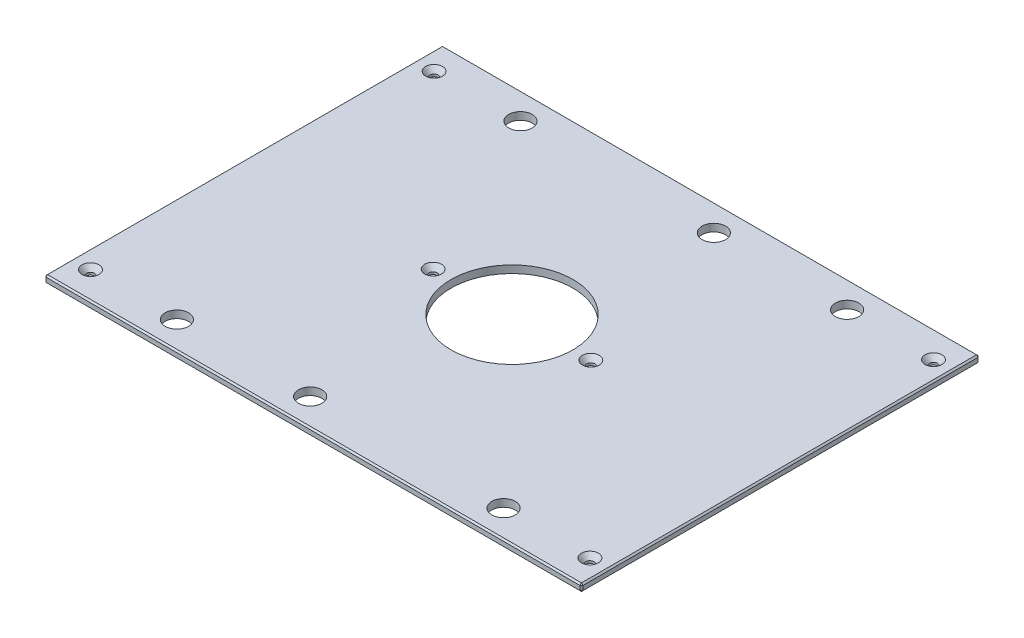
from build123d import *

# Parameters (mm, degrees)
SKETCH1_W                                     = 454.025
SKETCH1_H                                     = 336.55
BOSS_EXTRUDE1_DEPTH                           = 6.35
SKETCH13_R                                    = 51.562
CUT_EXTRUDE6_DEPTH                            = 283.650797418
F_25_32_0_78125_DIAMETER_HOLE1_D              = 19.84375
CHAMFER2_SIZE                                 = 1.27
CSK_FOR_1_4_FLAT_HEAD_MACHINE_SCREW1_AT_COUNT = 2
CSK_FOR_1_4_FLAT_HEAD_MACHINE_SCREW1_AT_PITCH = 290.50996
CSK_FOR_1_4_FLAT_HEAD_MACHINE_SCREW1_2_COUNT  = 2
CSK_FOR_1_4_FLAT_HEAD_MACHINE_SCREW1_2_PITCH  = 512.554594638
CSK_FOR_1_4_FLAT_HEAD_MACHINE_SCREW1_3_COUNT  = 2
CSK_FOR_1_4_FLAT_HEAD_MACHINE_SCREW1_3_PITCH  = 313.494488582
CSK_FOR_1_4_FLAT_HEAD_MACHINE_SCREW1_4_COUNT  = 2
CSK_FOR_1_4_FLAT_HEAD_MACHINE_SCREW1_4_PITCH  = 204.861961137
CSK_FOR_1_4_FLAT_HEAD_MACHINE_SCREW1_5_COUNT  = 2
CSK_FOR_1_4_FLAT_HEAD_MACHINE_SCREW1_5_PITCH  = 422.275
CSK_FOR_1_4_FLAT_HEAD_MACHINE_SCREW1_6_COUNT  = 2
CSK_FOR_1_4_FLAT_HEAD_MACHINE_SCREW1_6_PITCH  = 349.25
CSK_FOR_1_4_FLAT_HEAD_MACHINE_SCREW1_7_COUNT  = 2
CSK_FOR_1_4_FLAT_HEAD_MACHINE_SCREW1_7_PITCH  = 454.281409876


with BuildPart() as part:
    # Sketch1 → Boss-Extrude1 (new body)
    with BuildSketch(Plane(origin=(0, 0, 0), x_dir=(1, 0, 0), z_dir=(0, 1, 0))):
        Rectangle(SKETCH1_W, SKETCH1_H)
    extrude(amount=BOSS_EXTRUDE1_DEPTH)

    # Sketch13 → Cut-Extrude6 (cut, through all)
    with BuildSketch(Plane(origin=(0, 6.35, 0), x_dir=(1, 0, 0), z_dir=(0, 1, 0))):
        with Locations(Location((0, 0, 0), (0, 0, 270))):
            Circle(SKETCH13_R)
    extrude(amount=-CUT_EXTRUDE6_DEPTH, mode=Mode.SUBTRACT)

    # 25_32 _0.78125_ Diameter Hole1 (through all)
    with Locations(Plane(origin=(0, 6.35, 0), x_dir=(1, 0, 0), z_dir=(0, 1, 0))):
        with Locations((138.1125, 145.25498), (-138.1125, 145.25498), (138.1125, -145.25498), (-138.1125, -145.25498), (25.4, 145.25498), (-25.4, -145.25498)):
            Hole(F_25_32_0_78125_DIAMETER_HOLE1_D / 2)

    # Chamfer2
    chamfer2_edges = [part.edges().sort_by_distance(p)[0] for p in [
        (227.0125, 6.35, 0),
        (0, 6.35, -168.275),
        (-227.0125, 6.35, 0),
        (0, 0, -168.275),
        (227.0125, 0, 0),
        (0, 0, 168.275),
        (-227.0125, 0, 0),
        (0, 6.35, 168.275),
        (-227.0125, 3.175, -168.275),
        (227.0125, 3.175, -168.275),
        (227.0125, 3.175, 168.275),
        (-227.0125, 3.175, 168.275),
    ]]
    chamfer(chamfer2_edges, length=CHAMFER2_SIZE)

    # Sketch24 → CSK for 1_4 Flat Head Machine Screw1 (revolve, cut)
    with BuildSketch(Plane(origin=(211.1375, 6.35, -145.25498), x_dir=(0, 0, 1), z_dir=(1, 0, 0))):
        Polygon((0, 0), (0, 6.35), (3.3782, 6.35), (3.3782, 4.324464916), (7.1374, 0), align=None)
    csk_for_1_4_flat_head_machine_screw1 = revolve(axis=Axis((211.1375, 12.7, -145.25498), (0, -1, 0)), mode=Mode.SUBTRACT)

    # CSK for 1_4 Flat Head Machine Screw1 at: CSK for 1_4 Flat Head Machine Screw1 ×2
    with Locations(*[(0, 0, i * CSK_FOR_1_4_FLAT_HEAD_MACHINE_SCREW1_AT_PITCH) for i in range(1, CSK_FOR_1_4_FLAT_HEAD_MACHINE_SCREW1_AT_COUNT)]):
        add(csk_for_1_4_flat_head_machine_screw1, mode=Mode.SUBTRACT)

    # CSK for 1_4 Flat Head Machine Screw1 2: CSK for 1_4 Flat Head Machine Screw1 ×2
    with Locations(*[Vector(-0.8238634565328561, 0, 0.5667883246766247) * (i * CSK_FOR_1_4_FLAT_HEAD_MACHINE_SCREW1_2_PITCH) for i in range(1, CSK_FOR_1_4_FLAT_HEAD_MACHINE_SCREW1_2_COUNT)]):
        add(csk_for_1_4_flat_head_machine_screw1, mode=Mode.SUBTRACT)

    # CSK for 1_4 Flat Head Machine Screw1 3: CSK for 1_4 Flat Head Machine Screw1 ×2
    with Locations(*[Vector(-0.8861798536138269, 0, 0.46334141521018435) * (i * CSK_FOR_1_4_FLAT_HEAD_MACHINE_SCREW1_3_PITCH) for i in range(1, CSK_FOR_1_4_FLAT_HEAD_MACHINE_SCREW1_3_COUNT)]):
        add(csk_for_1_4_flat_head_machine_screw1, mode=Mode.SUBTRACT)

    # CSK for 1_4 Flat Head Machine Screw1 4: CSK for 1_4 Flat Head Machine Screw1 ×2
    with Locations(*[Vector(-0.7051699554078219, 0, 0.7090383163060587) * (i * CSK_FOR_1_4_FLAT_HEAD_MACHINE_SCREW1_4_PITCH) for i in range(1, CSK_FOR_1_4_FLAT_HEAD_MACHINE_SCREW1_4_COUNT)]):
        add(csk_for_1_4_flat_head_machine_screw1, mode=Mode.SUBTRACT)

    # CSK for 1_4 Flat Head Machine Screw1 5: CSK for 1_4 Flat Head Machine Screw1 ×2
    with Locations(*[(-i * CSK_FOR_1_4_FLAT_HEAD_MACHINE_SCREW1_5_PITCH, 0, 0) for i in range(1, CSK_FOR_1_4_FLAT_HEAD_MACHINE_SCREW1_5_COUNT)]):
        add(csk_for_1_4_flat_head_machine_screw1, mode=Mode.SUBTRACT)

    # CSK for 1_4 Flat Head Machine Screw1 6: CSK for 1_4 Flat Head Machine Screw1 ×2
    with Locations(*[(-i * CSK_FOR_1_4_FLAT_HEAD_MACHINE_SCREW1_6_PITCH, 0, 0) for i in range(1, CSK_FOR_1_4_FLAT_HEAD_MACHINE_SCREW1_6_COUNT)]):
        add(csk_for_1_4_flat_head_machine_screw1, mode=Mode.SUBTRACT)

    # CSK for 1_4 Flat Head Machine Screw1 7: CSK for 1_4 Flat Head Machine Screw1 ×2
    with Locations(*[Vector(-0.7687965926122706, 0, 0.639493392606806) * (i * CSK_FOR_1_4_FLAT_HEAD_MACHINE_SCREW1_7_PITCH) for i in range(1, CSK_FOR_1_4_FLAT_HEAD_MACHINE_SCREW1_7_COUNT)]):
        add(csk_for_1_4_flat_head_machine_screw1, mode=Mode.SUBTRACT)


solid = part.part
